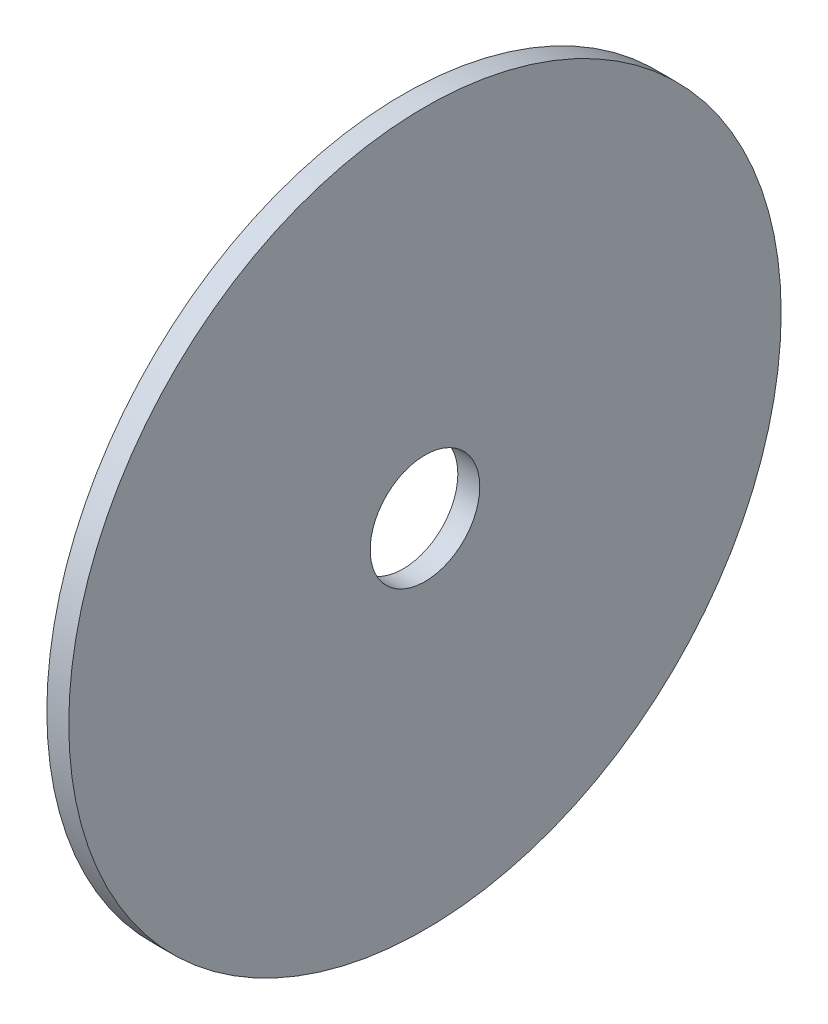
ISO-10303-21;
HEADER;
FILE_DESCRIPTION(('STEP AP214'),'2;1');
FILE_NAME('part.step','',(''),(''),'','','');
FILE_SCHEMA(('AUTOMOTIVE_DESIGN { 1 0 10303 214 1 1 1 1 }'));
ENDSEC;
DATA;
#1=APPLICATION_CONTEXT('core data for automotive mechanical design processes');
#2=APPLICATION_PROTOCOL_DEFINITION('international standard','automotive_design',2000,#1);
#3=PRODUCT_CONTEXT('',#1,'mechanical');
#4=PRODUCT('Part','Part','',(#3));
#5=PRODUCT_RELATED_PRODUCT_CATEGORY('part','',(#4));
#6=PRODUCT_DEFINITION_FORMATION('','',#4);
#7=PRODUCT_DEFINITION_CONTEXT('part definition',#1,'design');
#8=PRODUCT_DEFINITION('design','',#6,#7);
#9=PRODUCT_DEFINITION_SHAPE('','',#8);
#10=(LENGTH_UNIT() NAMED_UNIT(*) SI_UNIT(.MILLI.,.METRE.));
#11=(NAMED_UNIT(*) PLANE_ANGLE_UNIT() SI_UNIT($,.RADIAN.));
#12=(NAMED_UNIT(*) SI_UNIT($,.STERADIAN.) SOLID_ANGLE_UNIT());
#13=UNCERTAINTY_MEASURE_WITH_UNIT(LENGTH_MEASURE(1.E-05),#10,'distance_accuracy_value','');
#14=(GEOMETRIC_REPRESENTATION_CONTEXT(3) GLOBAL_UNCERTAINTY_ASSIGNED_CONTEXT((#13)) GLOBAL_UNIT_ASSIGNED_CONTEXT((#10,
#11,#12)) REPRESENTATION_CONTEXT('',''));
#15=CARTESIAN_POINT('',(0.,0.,0.));
#16=DIRECTION('',(0.,0.,1.));
#17=DIRECTION('',(1.,0.,0.));
#18=AXIS2_PLACEMENT_3D('',#15,#16,#17);
#19=CARTESIAN_POINT('',(2.,0.,0.));
#20=DIRECTION('',(1.,0.,0.));
#21=DIRECTION('',(0.,0.,-1.));
#22=AXIS2_PLACEMENT_3D('',#19,#20,#21);
#23=PLANE('',#22);
#24=CARTESIAN_POINT('',(2.,0.,0.));
#25=DIRECTION('',(1.,0.,0.));
#26=DIRECTION('',(0.,0.,-1.));
#27=AXIS2_PLACEMENT_3D('',#24,#25,#26);
#28=CIRCLE('',#27,5.);
#29=CARTESIAN_POINT('',(2.,0.,-5.));
#30=VERTEX_POINT('',#29);
#31=EDGE_CURVE('E28',#30,#30,#28,.F.);
#32=ORIENTED_EDGE('',*,*,#31,.T.);
#33=EDGE_LOOP('',(#32));
#34=FACE_BOUND('',#33,.T.);
#35=CARTESIAN_POINT('',(2.,0.,0.));
#36=DIRECTION('',(1.,0.,0.));
#37=DIRECTION('',(0.,0.,-1.));
#38=AXIS2_PLACEMENT_3D('',#35,#36,#37);
#39=CIRCLE('',#38,32.5);
#40=CARTESIAN_POINT('',(2.,0.,-32.5));
#41=VERTEX_POINT('',#40);
#42=EDGE_CURVE('E19',#41,#41,#39,.F.);
#43=ORIENTED_EDGE('',*,*,#42,.F.);
#44=EDGE_LOOP('',(#43));
#45=FACE_BOUND('',#44,.T.);
#46=ADVANCED_FACE('F15',(#34,#45),#23,.T.);
#47=CARTESIAN_POINT('',(0.,0.,0.));
#48=DIRECTION('',(1.,0.,0.));
#49=DIRECTION('',(0.,0.,-1.));
#50=AXIS2_PLACEMENT_3D('',#47,#48,#49);
#51=CYLINDRICAL_SURFACE('',#50,32.5);
#52=ORIENTED_EDGE('',*,*,#42,.T.);
#53=EDGE_LOOP('',(#52));
#54=FACE_BOUND('',#53,.T.);
#55=CARTESIAN_POINT('',(0.,0.,0.));
#56=DIRECTION('',(1.,0.,0.));
#57=DIRECTION('',(0.,0.,-1.));
#58=AXIS2_PLACEMENT_3D('',#55,#56,#57);
#59=CIRCLE('',#58,32.5);
#60=CARTESIAN_POINT('',(0.,0.,-32.5));
#61=VERTEX_POINT('',#60);
#62=EDGE_CURVE('E23',#61,#61,#59,.T.);
#63=ORIENTED_EDGE('',*,*,#62,.T.);
#64=EDGE_LOOP('',(#63));
#65=FACE_BOUND('',#64,.T.);
#66=ADVANCED_FACE('F36',(#54,#65),#51,.T.);
#67=CARTESIAN_POINT('',(0.,0.,0.));
#68=DIRECTION('',(1.,0.,0.));
#69=DIRECTION('',(0.,0.,-1.));
#70=AXIS2_PLACEMENT_3D('',#67,#68,#69);
#71=CYLINDRICAL_SURFACE('',#70,5.);
#72=ORIENTED_EDGE('',*,*,#31,.F.);
#73=EDGE_LOOP('',(#72));
#74=FACE_BOUND('',#73,.T.);
#75=CARTESIAN_POINT('',(0.,0.,0.));
#76=DIRECTION('',(1.,0.,0.));
#77=DIRECTION('',(0.,0.,-1.));
#78=AXIS2_PLACEMENT_3D('',#75,#76,#77);
#79=CIRCLE('',#78,5.);
#80=CARTESIAN_POINT('',(0.,0.,-5.));
#81=VERTEX_POINT('',#80);
#82=EDGE_CURVE('E10',#81,#81,#79,.F.);
#83=ORIENTED_EDGE('',*,*,#82,.T.);
#84=EDGE_LOOP('',(#83));
#85=FACE_BOUND('',#84,.T.);
#86=ADVANCED_FACE('F45',(#74,#85),#71,.F.);
#87=CARTESIAN_POINT('',(0.,0.,0.));
#88=DIRECTION('',(1.,0.,0.));
#89=DIRECTION('',(0.,0.,-1.));
#90=AXIS2_PLACEMENT_3D('',#87,#88,#89);
#91=PLANE('',#90);
#92=ORIENTED_EDGE('',*,*,#82,.F.);
#93=EDGE_LOOP('',(#92));
#94=FACE_BOUND('',#93,.T.);
#95=ORIENTED_EDGE('',*,*,#62,.F.);
#96=EDGE_LOOP('',(#95));
#97=FACE_BOUND('',#96,.T.);
#98=ADVANCED_FACE('F17',(#94,#97),#91,.F.);
#99=CLOSED_SHELL('',(#46,#66,#86,#98));
#100=MANIFOLD_SOLID_BREP('B1',#99);
#101=ADVANCED_BREP_SHAPE_REPRESENTATION('',(#18,#100),#14);
#102=SHAPE_DEFINITION_REPRESENTATION(#9,#101);
ENDSEC;
END-ISO-10303-21;
